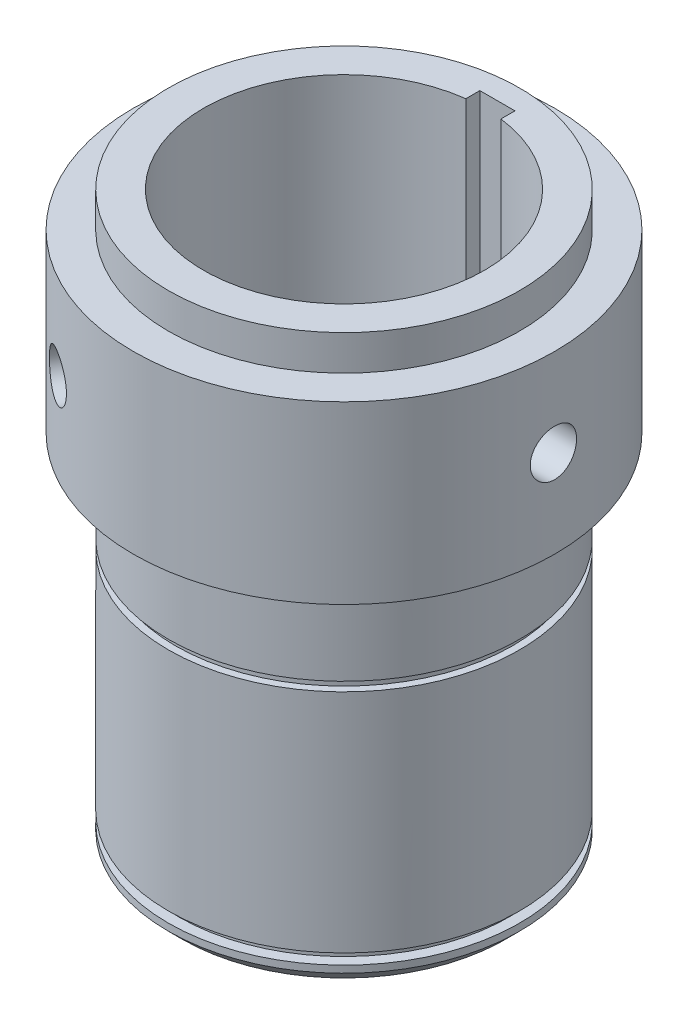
from build123d import *

# Parameters (mm, degrees)
CHANFREIN1_SIZE              = 2
R_P_TITION_CIRCULAIRE1_COUNT = 3
ESQUISSE4_W                  = 5
ESQUISSE4_H                  = 2
ENL_V_MAT_EXTRU_1_DEPTH      = 92.438503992
ESQUISSE5_OUTSIDE_W          = 85.462
ESQUISSE5_OUTSIDE_H          = 85.462
ESQUISSE5_OUTSIDE_R          = 24
ENL_V_MAT_EXTRU_2_DEPTH      = 1.3


with BuildPart() as part:
    # Esquisse1 → R_volution1 (revolve)
    with BuildSketch(Plane.XY, mode=Mode.PRIVATE) as r_volution1_sk:
        Polygon((20, -50.446584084), (25, -50.446584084), (25, -47.446584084), (23.5, -47.446584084), (23.5, -45.946584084), (25, -45.946584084), (25, 0.553415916), (30, 0.553415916), (30, 25.553415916), (25, 25.553415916), (25, 30.553415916), (20, 30.553415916), align=None)
    revolve(r_volution1_sk.sketch.rotate(Axis((0, 69.866341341, 0), (0, -1, 0)), 90), axis=Axis((0, 69.866341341, 0), (0, -1, 0)))

    # Chanfrein1
    chanfrein1_edges = [part.edges().sort_by_distance(p)[0] for p in [
        (0, -50.446584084, -25),
    ]]
    chamfer(chanfrein1_edges, length=CHANFREIN1_SIZE)

    # Esquisse2 → D_gagement M61 (revolve, cut)
    with BuildSketch(Plane(origin=(30, 13.053415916, 0), x_dir=(0, 0, -1), z_dir=(0, 1, 0))):
        Polygon((0, 0), (0, 8.982840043), (3.3, 7), (3.3, 0), align=None)
    d_gagement_m61 = revolve(axis=Axis((36.35, 13.053415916, 0), (-1, 0, 0)), mode=Mode.SUBTRACT)

    # R_p_tition circulaire1: D_gagement M61 ×3 about axis
    r_p_tition_circulaire1_axis = Axis((0, 17.403415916, 0), (0, -1, 0))
    for i in range(1, R_P_TITION_CIRCULAIRE1_COUNT):
        add(d_gagement_m61.rotate(r_p_tition_circulaire1_axis, i * 360 / R_P_TITION_CIRCULAIRE1_COUNT), mode=Mode.SUBTRACT)

    # Esquisse4 → Enl_v. mat.-Extru.1 (cut, through all)
    with BuildSketch(Plane(origin=(0, 30.553415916, 0), x_dir=(1, 0, 0), z_dir=(0, 1, 0))):
        with Locations((0, 20.843134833)):
            Rectangle(ESQUISSE4_W, ESQUISSE4_H)
    extrude(amount=-ENL_V_MAT_EXTRU_1_DEPTH, mode=Mode.SUBTRACT)

    # Esquisse5 outside → Enl_v. mat.-Extru.2 (cut)
    with BuildSketch(Plane.XZ.offset(12.446584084)):
        Rectangle(ESQUISSE5_OUTSIDE_W, ESQUISSE5_OUTSIDE_H)
        with Locations(Location((0, 0, 0), (0, 0, 270))):
            Circle(ESQUISSE5_OUTSIDE_R, mode=Mode.SUBTRACT)
    extrude(amount=ENL_V_MAT_EXTRU_2_DEPTH, mode=Mode.SUBTRACT)


solid = part.part
